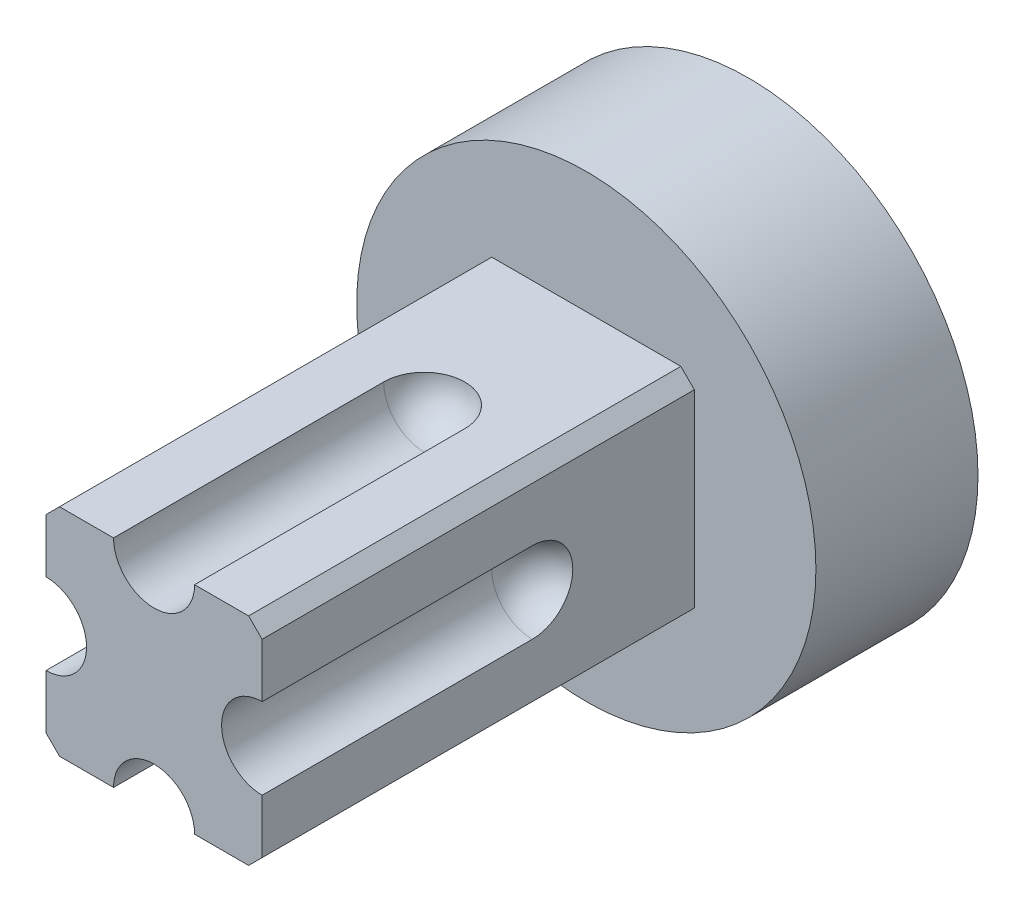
ISO-10303-21;
HEADER;
FILE_DESCRIPTION(('STEP AP214'),'2;1');
FILE_NAME('part.step','',(''),(''),'','','');
FILE_SCHEMA(('AUTOMOTIVE_DESIGN { 1 0 10303 214 1 1 1 1 }'));
ENDSEC;
DATA;
#1=APPLICATION_CONTEXT('core data for automotive mechanical design processes');
#2=APPLICATION_PROTOCOL_DEFINITION('international standard','automotive_design',2000,#1);
#3=PRODUCT_CONTEXT('',#1,'mechanical');
#4=PRODUCT('Part','Part','',(#3));
#5=PRODUCT_RELATED_PRODUCT_CATEGORY('part','',(#4));
#6=PRODUCT_DEFINITION_FORMATION('','',#4);
#7=PRODUCT_DEFINITION_CONTEXT('part definition',#1,'design');
#8=PRODUCT_DEFINITION('design','',#6,#7);
#9=PRODUCT_DEFINITION_SHAPE('','',#8);
#10=(LENGTH_UNIT() NAMED_UNIT(*) SI_UNIT(.MILLI.,.METRE.));
#11=(NAMED_UNIT(*) PLANE_ANGLE_UNIT() SI_UNIT($,.RADIAN.));
#12=(NAMED_UNIT(*) SI_UNIT($,.STERADIAN.) SOLID_ANGLE_UNIT());
#13=UNCERTAINTY_MEASURE_WITH_UNIT(LENGTH_MEASURE(1.E-05),#10,'distance_accuracy_value','');
#14=(GEOMETRIC_REPRESENTATION_CONTEXT(3) GLOBAL_UNCERTAINTY_ASSIGNED_CONTEXT((#13)) GLOBAL_UNIT_ASSIGNED_CONTEXT((#10,
#11,#12)) REPRESENTATION_CONTEXT('',''));
#15=CARTESIAN_POINT('',(0.,0.,0.));
#16=DIRECTION('',(0.,0.,1.));
#17=DIRECTION('',(1.,0.,0.));
#18=AXIS2_PLACEMENT_3D('',#15,#16,#17);
#19=CARTESIAN_POINT('',(-88.9,76.2000000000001,34.925));
#20=DIRECTION('',(0.,0.,1.));
#21=DIRECTION('',(1.,0.,0.));
#22=AXIS2_PLACEMENT_3D('',#19,#20,#21);
#23=PLANE('',#22);
#24=DIRECTION('',(1.,0.,0.));
#25=VECTOR('',#24,1.);
#26=CARTESIAN_POINT('',(-88.9,76.2000000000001,34.925));
#27=LINE('',#26,#25);
#28=CARTESIAN_POINT('',(-80.16875,76.2000000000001,34.925));
#29=VERTEX_POINT('',#28);
#30=CARTESIAN_POINT('',(-76.99375,76.2000000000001,34.925));
#31=VERTEX_POINT('',#30);
#32=EDGE_CURVE('E191',#29,#31,#27,.T.);
#33=ORIENTED_EDGE('',*,*,#32,.T.);
#34=DIRECTION('',(-0.707106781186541,-0.707106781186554,0.));
#35=VECTOR('',#34,1.);
#36=CARTESIAN_POINT('',(-82.9468749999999,70.2468750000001,34.925));
#37=LINE('',#36,#35);
#38=CARTESIAN_POINT('',(-76.2,76.9937500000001,34.925));
#39=VERTEX_POINT('',#38);
#40=EDGE_CURVE('E256',#31,#39,#37,.F.);
#41=ORIENTED_EDGE('',*,*,#40,.T.);
#42=DIRECTION('',(0.,1.,0.));
#43=VECTOR('',#42,1.);
#44=CARTESIAN_POINT('',(-76.2,88.9000000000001,34.925));
#45=LINE('',#44,#43);
#46=CARTESIAN_POINT('',(-76.2,80.1687500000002,34.925));
#47=VERTEX_POINT('',#46);
#48=EDGE_CURVE('E196',#39,#47,#45,.T.);
#49=ORIENTED_EDGE('',*,*,#48,.T.);
#50=CARTESIAN_POINT('',(-76.2,82.5500000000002,34.925));
#51=DIRECTION('',(0.,0.,1.));
#52=DIRECTION('',(1.,0.,0.));
#53=AXIS2_PLACEMENT_3D('',#50,#51,#52);
#54=CIRCLE('',#53,2.38125);
#55=CARTESIAN_POINT('',(-76.2,84.9312500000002,34.925));
#56=VERTEX_POINT('',#55);
#57=EDGE_CURVE('E172',#47,#56,#54,.F.);
#58=ORIENTED_EDGE('',*,*,#57,.T.);
#59=CARTESIAN_POINT('',(-76.2,88.1062500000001,34.925));
#60=VERTEX_POINT('',#59);
#61=EDGE_CURVE('E195',#56,#60,#45,.T.);
#62=ORIENTED_EDGE('',*,*,#61,.T.);
#63=DIRECTION('',(0.707106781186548,-0.707106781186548,0.));
#64=VECTOR('',#63,1.);
#65=CARTESIAN_POINT('',(-76.596875,88.5031250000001,34.925));
#66=LINE('',#65,#64);
#67=CARTESIAN_POINT('',(-76.99375,88.9000000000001,34.925));
#68=VERTEX_POINT('',#67);
#69=EDGE_CURVE('E250',#60,#68,#66,.F.);
#70=ORIENTED_EDGE('',*,*,#69,.T.);
#71=DIRECTION('',(-1.,0.,0.));
#72=VECTOR('',#71,1.);
#73=CARTESIAN_POINT('',(-88.9,88.9000000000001,34.925));
#74=LINE('',#73,#72);
#75=CARTESIAN_POINT('',(-80.1687500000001,88.9000000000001,34.925));
#76=VERTEX_POINT('',#75);
#77=EDGE_CURVE('E199',#68,#76,#74,.T.);
#78=ORIENTED_EDGE('',*,*,#77,.T.);
#79=CARTESIAN_POINT('',(-82.5500000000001,88.9000000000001,34.925));
#80=DIRECTION('',(0.,0.,1.));
#81=DIRECTION('',(1.,0.,0.));
#82=AXIS2_PLACEMENT_3D('',#79,#80,#81);
#83=CIRCLE('',#82,2.38125);
#84=CARTESIAN_POINT('',(-84.9312500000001,88.9000000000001,34.925));
#85=VERTEX_POINT('',#84);
#86=EDGE_CURVE('E178',#76,#85,#83,.F.);
#87=ORIENTED_EDGE('',*,*,#86,.T.);
#88=CARTESIAN_POINT('',(-88.10625,88.9000000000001,34.925));
#89=VERTEX_POINT('',#88);
#90=EDGE_CURVE('E198',#85,#89,#74,.T.);
#91=ORIENTED_EDGE('',*,*,#90,.T.);
#92=DIRECTION('',(0.707106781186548,0.707106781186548,0.));
#93=VECTOR('',#92,1.);
#94=CARTESIAN_POINT('',(-94.853125,82.1531250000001,34.925));
#95=LINE('',#94,#93);
#96=CARTESIAN_POINT('',(-88.9,88.1062500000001,34.925));
#97=VERTEX_POINT('',#96);
#98=EDGE_CURVE('E252',#89,#97,#95,.F.);
#99=ORIENTED_EDGE('',*,*,#98,.T.);
#100=DIRECTION('',(0.,-1.,0.));
#101=VECTOR('',#100,1.);
#102=CARTESIAN_POINT('',(-88.9,88.9000000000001,34.925));
#103=LINE('',#102,#101);
#104=CARTESIAN_POINT('',(-88.9,84.93125,34.925));
#105=VERTEX_POINT('',#104);
#106=EDGE_CURVE('E189',#97,#105,#103,.T.);
#107=ORIENTED_EDGE('',*,*,#106,.T.);
#108=CARTESIAN_POINT('',(-88.9,82.55,34.925));
#109=DIRECTION('',(0.,0.,1.));
#110=DIRECTION('',(1.,0.,0.));
#111=AXIS2_PLACEMENT_3D('',#108,#109,#110);
#112=CIRCLE('',#111,2.38125);
#113=CARTESIAN_POINT('',(-88.9,80.16875,34.925));
#114=VERTEX_POINT('',#113);
#115=EDGE_CURVE('E215',#105,#114,#112,.F.);
#116=ORIENTED_EDGE('',*,*,#115,.T.);
#117=CARTESIAN_POINT('',(-88.9,76.9937500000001,34.925));
#118=VERTEX_POINT('',#117);
#119=EDGE_CURVE('E192',#114,#118,#103,.T.);
#120=ORIENTED_EDGE('',*,*,#119,.T.);
#121=DIRECTION('',(-0.707106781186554,0.707106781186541,0.));
#122=VECTOR('',#121,1.);
#123=CARTESIAN_POINT('',(-88.503125,76.5968750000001,34.925));
#124=LINE('',#123,#122);
#125=CARTESIAN_POINT('',(-88.10625,76.2000000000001,34.925));
#126=VERTEX_POINT('',#125);
#127=EDGE_CURVE('E254',#118,#126,#124,.F.);
#128=ORIENTED_EDGE('',*,*,#127,.T.);
#129=CARTESIAN_POINT('',(-84.93125,76.2000000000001,34.925));
#130=VERTEX_POINT('',#129);
#131=EDGE_CURVE('E193',#126,#130,#27,.T.);
#132=ORIENTED_EDGE('',*,*,#131,.T.);
#133=CARTESIAN_POINT('',(-82.55,76.2000000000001,34.925));
#134=DIRECTION('',(0.,0.,1.));
#135=DIRECTION('',(1.,0.,0.));
#136=AXIS2_PLACEMENT_3D('',#133,#134,#135);
#137=CIRCLE('',#136,2.38125);
#138=EDGE_CURVE('E162',#130,#29,#137,.F.);
#139=ORIENTED_EDGE('',*,*,#138,.T.);
#140=EDGE_LOOP('',(#33,#41,#49,#58,#62,#70,#78,#87,#91,#99,#107,#116,#120,#128,#132,#139));
#141=FACE_BOUND('',#140,.T.);
#142=ADVANCED_FACE('F36',(#141),#23,.T.);
#143=CARTESIAN_POINT('',(-88.9,76.2000000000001,34.925));
#144=DIRECTION('',(0.,1.,0.));
#145=DIRECTION('',(0.,0.,1.));
#146=AXIS2_PLACEMENT_3D('',#143,#144,#145);
#147=PLANE('',#146);
#148=DIRECTION('',(1.,0.,0.));
#149=VECTOR('',#148,1.);
#150=CARTESIAN_POINT('',(-88.9,76.2000000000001,9.525));
#151=LINE('',#150,#149);
#152=CARTESIAN_POINT('',(-88.10625,76.2000000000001,9.525));
#153=VERTEX_POINT('',#152);
#154=CARTESIAN_POINT('',(-76.99375,76.2000000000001,9.525));
#155=VERTEX_POINT('',#154);
#156=EDGE_CURVE('E204',#153,#155,#151,.T.);
#157=ORIENTED_EDGE('',*,*,#156,.T.);
#158=DIRECTION('',(0.,0.,1.));
#159=VECTOR('',#158,1.);
#160=CARTESIAN_POINT('',(-76.99375,76.2000000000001,34.925));
#161=LINE('',#160,#159);
#162=EDGE_CURVE('E248',#155,#31,#161,.T.);
#163=ORIENTED_EDGE('',*,*,#162,.T.);
#164=ORIENTED_EDGE('',*,*,#32,.F.);
#165=DIRECTION('',(0.,0.,-1.));
#166=VECTOR('',#165,1.);
#167=CARTESIAN_POINT('',(-80.16875,76.2000000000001,53.2153504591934));
#168=LINE('',#167,#166);
#169=CARTESIAN_POINT('',(-80.16875,76.2000000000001,19.05));
#170=VERTEX_POINT('',#169);
#171=EDGE_CURVE('E238',#170,#29,#168,.F.);
#172=ORIENTED_EDGE('',*,*,#171,.F.);
#173=CARTESIAN_POINT('',(-82.55,76.2000000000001,19.05));
#174=DIRECTION('',(0.,1.,0.));
#175=DIRECTION('',(0.,0.,1.));
#176=AXIS2_PLACEMENT_3D('',#173,#174,#175);
#177=CIRCLE('',#176,2.38125);
#178=CARTESIAN_POINT('',(-84.93125,76.2000000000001,19.05));
#179=VERTEX_POINT('',#178);
#180=EDGE_CURVE('E236',#179,#170,#177,.F.);
#181=ORIENTED_EDGE('',*,*,#180,.F.);
#182=DIRECTION('',(0.,0.,-1.));
#183=VECTOR('',#182,1.);
#184=CARTESIAN_POINT('',(-84.93125,76.2000000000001,53.2153504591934));
#185=LINE('',#184,#183);
#186=EDGE_CURVE('E234',#130,#179,#185,.T.);
#187=ORIENTED_EDGE('',*,*,#186,.F.);
#188=ORIENTED_EDGE('',*,*,#131,.F.);
#189=DIRECTION('',(0.,0.,-1.));
#190=VECTOR('',#189,1.);
#191=CARTESIAN_POINT('',(-88.10625,76.2000000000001,34.925));
#192=LINE('',#191,#190);
#193=EDGE_CURVE('E245',#126,#153,#192,.T.);
#194=ORIENTED_EDGE('',*,*,#193,.T.);
#195=EDGE_LOOP('',(#157,#163,#164,#172,#181,#187,#188,#194));
#196=FACE_BOUND('',#195,.T.);
#197=ADVANCED_FACE('F289',(#196),#147,.F.);
#198=CARTESIAN_POINT('',(-76.2,88.9000000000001,34.925));
#199=DIRECTION('',(-1.,0.,0.));
#200=DIRECTION('',(0.,0.,1.));
#201=AXIS2_PLACEMENT_3D('',#198,#199,#200);
#202=PLANE('',#201);
#203=ORIENTED_EDGE('',*,*,#48,.F.);
#204=DIRECTION('',(0.,0.,-1.));
#205=VECTOR('',#204,1.);
#206=CARTESIAN_POINT('',(-76.2,76.9937500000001,34.925));
#207=LINE('',#206,#205);
#208=CARTESIAN_POINT('',(-76.2,76.9937500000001,9.525));
#209=VERTEX_POINT('',#208);
#210=EDGE_CURVE('E242',#39,#209,#207,.T.);
#211=ORIENTED_EDGE('',*,*,#210,.T.);
#212=DIRECTION('',(0.,1.,0.));
#213=VECTOR('',#212,1.);
#214=CARTESIAN_POINT('',(-76.2,88.9000000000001,9.525));
#215=LINE('',#214,#213);
#216=CARTESIAN_POINT('',(-76.2,88.1062500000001,9.525));
#217=VERTEX_POINT('',#216);
#218=EDGE_CURVE('E207',#209,#217,#215,.T.);
#219=ORIENTED_EDGE('',*,*,#218,.T.);
#220=DIRECTION('',(0.,0.,1.));
#221=VECTOR('',#220,1.);
#222=CARTESIAN_POINT('',(-76.2,88.1062500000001,34.925));
#223=LINE('',#222,#221);
#224=EDGE_CURVE('E240',#217,#60,#223,.T.);
#225=ORIENTED_EDGE('',*,*,#224,.T.);
#226=ORIENTED_EDGE('',*,*,#61,.F.);
#227=DIRECTION('',(0.,0.,-1.));
#228=VECTOR('',#227,1.);
#229=CARTESIAN_POINT('',(-76.2,84.9312500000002,53.2153504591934));
#230=LINE('',#229,#228);
#231=CARTESIAN_POINT('',(-76.2,84.9312500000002,19.05));
#232=VERTEX_POINT('',#231);
#233=EDGE_CURVE('E232',#232,#56,#230,.F.);
#234=ORIENTED_EDGE('',*,*,#233,.F.);
#235=CARTESIAN_POINT('',(-76.2,82.5500000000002,19.05));
#236=DIRECTION('',(-1.,0.,0.));
#237=DIRECTION('',(0.,0.,1.));
#238=AXIS2_PLACEMENT_3D('',#235,#236,#237);
#239=CIRCLE('',#238,2.38125);
#240=CARTESIAN_POINT('',(-76.2,80.1687500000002,19.05));
#241=VERTEX_POINT('',#240);
#242=EDGE_CURVE('E230',#241,#232,#239,.F.);
#243=ORIENTED_EDGE('',*,*,#242,.F.);
#244=DIRECTION('',(0.,0.,-1.));
#245=VECTOR('',#244,1.);
#246=CARTESIAN_POINT('',(-76.2,80.1687500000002,53.2153504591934));
#247=LINE('',#246,#245);
#248=EDGE_CURVE('E228',#47,#241,#247,.T.);
#249=ORIENTED_EDGE('',*,*,#248,.F.);
#250=EDGE_LOOP('',(#203,#211,#219,#225,#226,#234,#243,#249));
#251=FACE_BOUND('',#250,.T.);
#252=ADVANCED_FACE('F314',(#251),#202,.F.);
#253=CARTESIAN_POINT('',(-88.9,88.9000000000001,34.925));
#254=DIRECTION('',(0.,-1.,0.));
#255=DIRECTION('',(0.,0.,-1.));
#256=AXIS2_PLACEMENT_3D('',#253,#254,#255);
#257=PLANE('',#256);
#258=DIRECTION('',(-1.,0.,0.));
#259=VECTOR('',#258,1.);
#260=CARTESIAN_POINT('',(-88.9,88.9000000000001,9.525));
#261=LINE('',#260,#259);
#262=CARTESIAN_POINT('',(-76.99375,88.9000000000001,9.525));
#263=VERTEX_POINT('',#262);
#264=CARTESIAN_POINT('',(-88.10625,88.9000000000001,9.525));
#265=VERTEX_POINT('',#264);
#266=EDGE_CURVE('E210',#263,#265,#261,.T.);
#267=ORIENTED_EDGE('',*,*,#266,.T.);
#268=DIRECTION('',(0.,0.,1.));
#269=VECTOR('',#268,1.);
#270=CARTESIAN_POINT('',(-88.10625,88.9000000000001,34.925));
#271=LINE('',#270,#269);
#272=EDGE_CURVE('E265',#265,#89,#271,.T.);
#273=ORIENTED_EDGE('',*,*,#272,.T.);
#274=ORIENTED_EDGE('',*,*,#90,.F.);
#275=DIRECTION('',(0.,0.,-1.));
#276=VECTOR('',#275,1.);
#277=CARTESIAN_POINT('',(-84.9312500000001,88.9000000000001,53.2153504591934));
#278=LINE('',#277,#276);
#279=CARTESIAN_POINT('',(-84.9312500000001,88.9000000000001,19.05));
#280=VERTEX_POINT('',#279);
#281=EDGE_CURVE('E226',#280,#85,#278,.F.);
#282=ORIENTED_EDGE('',*,*,#281,.F.);
#283=CARTESIAN_POINT('',(-82.5500000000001,88.9000000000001,19.05));
#284=DIRECTION('',(0.,-1.,0.));
#285=DIRECTION('',(0.,0.,-1.));
#286=AXIS2_PLACEMENT_3D('',#283,#284,#285);
#287=CIRCLE('',#286,2.38125);
#288=CARTESIAN_POINT('',(-80.1687500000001,88.9000000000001,19.05));
#289=VERTEX_POINT('',#288);
#290=EDGE_CURVE('E224',#289,#280,#287,.F.);
#291=ORIENTED_EDGE('',*,*,#290,.F.);
#292=DIRECTION('',(0.,0.,-1.));
#293=VECTOR('',#292,1.);
#294=CARTESIAN_POINT('',(-80.1687500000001,88.9000000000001,53.2153504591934));
#295=LINE('',#294,#293);
#296=EDGE_CURVE('E222',#76,#289,#295,.T.);
#297=ORIENTED_EDGE('',*,*,#296,.F.);
#298=ORIENTED_EDGE('',*,*,#77,.F.);
#299=DIRECTION('',(0.,0.,-1.));
#300=VECTOR('',#299,1.);
#301=CARTESIAN_POINT('',(-76.99375,88.9000000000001,34.925));
#302=LINE('',#301,#300);
#303=EDGE_CURVE('E263',#68,#263,#302,.T.);
#304=ORIENTED_EDGE('',*,*,#303,.T.);
#305=EDGE_LOOP('',(#267,#273,#274,#282,#291,#297,#298,#304));
#306=FACE_BOUND('',#305,.T.);
#307=ADVANCED_FACE('F320',(#306),#257,.F.);
#308=CARTESIAN_POINT('',(-88.9,88.9000000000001,34.925));
#309=DIRECTION('',(1.,0.,0.));
#310=DIRECTION('',(0.,0.,-1.));
#311=AXIS2_PLACEMENT_3D('',#308,#309,#310);
#312=PLANE('',#311);
#313=DIRECTION('',(0.,-1.,0.));
#314=VECTOR('',#313,1.);
#315=CARTESIAN_POINT('',(-88.9,88.9000000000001,9.525));
#316=LINE('',#315,#314);
#317=CARTESIAN_POINT('',(-88.9,88.1062500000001,9.525));
#318=VERTEX_POINT('',#317);
#319=CARTESIAN_POINT('',(-88.9,76.9937500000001,9.525));
#320=VERTEX_POINT('',#319);
#321=EDGE_CURVE('E188',#318,#320,#316,.T.);
#322=ORIENTED_EDGE('',*,*,#321,.T.);
#323=DIRECTION('',(0.,0.,1.));
#324=VECTOR('',#323,1.);
#325=CARTESIAN_POINT('',(-88.9,76.9937500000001,34.925));
#326=LINE('',#325,#324);
#327=EDGE_CURVE('E261',#320,#118,#326,.T.);
#328=ORIENTED_EDGE('',*,*,#327,.T.);
#329=ORIENTED_EDGE('',*,*,#119,.F.);
#330=DIRECTION('',(0.,0.,-1.));
#331=VECTOR('',#330,1.);
#332=CARTESIAN_POINT('',(-88.9,80.16875,53.2153504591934));
#333=LINE('',#332,#331);
#334=CARTESIAN_POINT('',(-88.9,80.16875,19.05));
#335=VERTEX_POINT('',#334);
#336=EDGE_CURVE('E186',#335,#114,#333,.F.);
#337=ORIENTED_EDGE('',*,*,#336,.F.);
#338=CARTESIAN_POINT('',(-88.9,82.55,19.05));
#339=DIRECTION('',(1.,0.,0.));
#340=DIRECTION('',(0.,0.,-1.));
#341=AXIS2_PLACEMENT_3D('',#338,#339,#340);
#342=CIRCLE('',#341,2.38125);
#343=CARTESIAN_POINT('',(-88.9,84.93125,19.05));
#344=VERTEX_POINT('',#343);
#345=EDGE_CURVE('E220',#344,#335,#342,.F.);
#346=ORIENTED_EDGE('',*,*,#345,.F.);
#347=DIRECTION('',(0.,0.,-1.));
#348=VECTOR('',#347,1.);
#349=CARTESIAN_POINT('',(-88.9,84.93125,53.2153504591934));
#350=LINE('',#349,#348);
#351=EDGE_CURVE('E184',#105,#344,#350,.T.);
#352=ORIENTED_EDGE('',*,*,#351,.F.);
#353=ORIENTED_EDGE('',*,*,#106,.F.);
#354=DIRECTION('',(0.,0.,-1.));
#355=VECTOR('',#354,1.);
#356=CARTESIAN_POINT('',(-88.9,88.1062500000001,34.925));
#357=LINE('',#356,#355);
#358=EDGE_CURVE('E258',#97,#318,#357,.T.);
#359=ORIENTED_EDGE('',*,*,#358,.T.);
#360=EDGE_LOOP('',(#322,#328,#329,#337,#346,#352,#353,#359));
#361=FACE_BOUND('',#360,.T.);
#362=ADVANCED_FACE('F276',(#361),#312,.F.);
#363=CARTESIAN_POINT('',(-82.55,82.5500000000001,9.525));
#364=DIRECTION('',(0.,0.,1.));
#365=DIRECTION('',(1.,0.,0.));
#366=AXIS2_PLACEMENT_3D('',#363,#364,#365);
#367=PLANE('',#366);
#368=CARTESIAN_POINT('',(-82.55,82.5500000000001,9.525));
#369=DIRECTION('',(0.,0.,1.));
#370=DIRECTION('',(1.,0.,0.));
#371=AXIS2_PLACEMENT_3D('',#368,#369,#370);
#372=CIRCLE('',#371,13.49375);
#373=CARTESIAN_POINT('',(-69.05625,82.5500000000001,9.525));
#374=VERTEX_POINT('',#373);
#375=EDGE_CURVE('E212',#374,#374,#372,.T.);
#376=ORIENTED_EDGE('',*,*,#375,.T.);
#377=EDGE_LOOP('',(#376));
#378=FACE_BOUND('',#377,.T.);
#379=ORIENTED_EDGE('',*,*,#156,.F.);
#380=DIRECTION('',(0.707106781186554,-0.707106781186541,0.));
#381=VECTOR('',#380,1.);
#382=CARTESIAN_POINT('',(-88.10625,76.2000000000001,9.525));
#383=LINE('',#382,#381);
#384=EDGE_CURVE('E269',#153,#320,#383,.F.);
#385=ORIENTED_EDGE('',*,*,#384,.T.);
#386=ORIENTED_EDGE('',*,*,#321,.F.);
#387=DIRECTION('',(-0.707106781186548,-0.707106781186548,0.));
#388=VECTOR('',#387,1.);
#389=CARTESIAN_POINT('',(-88.9,88.1062500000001,9.525));
#390=LINE('',#389,#388);
#391=EDGE_CURVE('E44',#318,#265,#390,.F.);
#392=ORIENTED_EDGE('',*,*,#391,.T.);
#393=ORIENTED_EDGE('',*,*,#266,.F.);
#394=DIRECTION('',(-0.707106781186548,0.707106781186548,0.));
#395=VECTOR('',#394,1.);
#396=CARTESIAN_POINT('',(-76.99375,88.9000000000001,9.525));
#397=LINE('',#396,#395);
#398=EDGE_CURVE('E11',#263,#217,#397,.F.);
#399=ORIENTED_EDGE('',*,*,#398,.T.);
#400=ORIENTED_EDGE('',*,*,#218,.F.);
#401=DIRECTION('',(0.707106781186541,0.707106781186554,0.));
#402=VECTOR('',#401,1.);
#403=CARTESIAN_POINT('',(-76.2,76.9937500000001,9.525));
#404=LINE('',#403,#402);
#405=EDGE_CURVE('E267',#209,#155,#404,.F.);
#406=ORIENTED_EDGE('',*,*,#405,.T.);
#407=EDGE_LOOP('',(#379,#385,#386,#392,#393,#399,#400,#406));
#408=FACE_BOUND('',#407,.T.);
#409=ADVANCED_FACE('F271',(#378,#408),#367,.T.);
#410=CARTESIAN_POINT('',(-82.55,82.5500000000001,9.525));
#411=DIRECTION('',(0.,0.,-1.));
#412=DIRECTION('',(-1.,0.,0.));
#413=AXIS2_PLACEMENT_3D('',#410,#411,#412);
#414=CYLINDRICAL_SURFACE('',#413,13.49375);
#415=ORIENTED_EDGE('',*,*,#375,.F.);
#416=EDGE_LOOP('',(#415));
#417=FACE_BOUND('',#416,.T.);
#418=CARTESIAN_POINT('',(-82.55,82.5500000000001,0.));
#419=DIRECTION('',(0.,0.,1.));
#420=DIRECTION('',(1.,0.,0.));
#421=AXIS2_PLACEMENT_3D('',#418,#419,#420);
#422=CIRCLE('',#421,13.49375);
#423=CARTESIAN_POINT('',(-69.05625,82.5500000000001,0.));
#424=VERTEX_POINT('',#423);
#425=EDGE_CURVE('E201',#424,#424,#422,.T.);
#426=ORIENTED_EDGE('',*,*,#425,.T.);
#427=EDGE_LOOP('',(#426));
#428=FACE_BOUND('',#427,.T.);
#429=ADVANCED_FACE('F331',(#417,#428),#414,.T.);
#430=CARTESIAN_POINT('',(-82.55,82.5500000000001,0.));
#431=DIRECTION('',(0.,0.,1.));
#432=DIRECTION('',(1.,0.,0.));
#433=AXIS2_PLACEMENT_3D('',#430,#431,#432);
#434=PLANE('',#433);
#435=CARTESIAN_POINT('',(-82.55,82.5500000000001,0.));
#436=DIRECTION('',(0.,0.,-1.));
#437=DIRECTION('',(-1.,0.,0.));
#438=AXIS2_PLACEMENT_3D('',#435,#436,#437);
#439=CIRCLE('',#438,3.2639);
#440=CARTESIAN_POINT('',(-85.8139,82.5500000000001,0.));
#441=VERTEX_POINT('',#440);
#442=EDGE_CURVE('E159',#441,#441,#439,.T.);
#443=ORIENTED_EDGE('',*,*,#442,.F.);
#444=EDGE_LOOP('',(#443));
#445=FACE_BOUND('',#444,.T.);
#446=ORIENTED_EDGE('',*,*,#425,.F.);
#447=EDGE_LOOP('',(#446));
#448=FACE_BOUND('',#447,.T.);
#449=ADVANCED_FACE('F333',(#445,#448),#434,.F.);
#450=CARTESIAN_POINT('',(-88.9,82.55,19.05));
#451=DIRECTION('',(0.,0.,-1.));
#452=DIRECTION('',(1.,0.,0.));
#453=AXIS2_PLACEMENT_3D('',#450,#451,#452);
#454=SPHERICAL_SURFACE('',#453,2.38125);
#455=ORIENTED_EDGE('',*,*,#345,.T.);
#456=CARTESIAN_POINT('',(-88.9,82.55,19.05));
#457=DIRECTION('',(0.,0.,-1.));
#458=DIRECTION('',(-1.,0.,0.));
#459=AXIS2_PLACEMENT_3D('',#456,#457,#458);
#460=CIRCLE('',#459,2.38125);
#461=EDGE_CURVE('E181',#344,#335,#460,.T.);
#462=ORIENTED_EDGE('',*,*,#461,.F.);
#463=EDGE_LOOP('',(#455,#462));
#464=FACE_BOUND('',#463,.T.);
#465=ADVANCED_FACE('F318',(#464),#454,.F.);
#466=CARTESIAN_POINT('',(-88.9,82.55,53.2153504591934));
#467=DIRECTION('',(0.,0.,-1.));
#468=DIRECTION('',(-1.,0.,0.));
#469=AXIS2_PLACEMENT_3D('',#466,#467,#468);
#470=CYLINDRICAL_SURFACE('',#469,2.38125);
#471=ORIENTED_EDGE('',*,*,#336,.T.);
#472=ORIENTED_EDGE('',*,*,#115,.F.);
#473=ORIENTED_EDGE('',*,*,#351,.T.);
#474=ORIENTED_EDGE('',*,*,#461,.T.);
#475=EDGE_LOOP('',(#471,#472,#473,#474));
#476=FACE_BOUND('',#475,.T.);
#477=ADVANCED_FACE('F360',(#476),#470,.F.);
#478=CARTESIAN_POINT('',(-82.5500000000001,88.9000000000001,19.05));
#479=DIRECTION('',(0.,0.,-1.));
#480=DIRECTION('',(0.,-1.,0.));
#481=AXIS2_PLACEMENT_3D('',#478,#479,#480);
#482=SPHERICAL_SURFACE('',#481,2.38125);
#483=ORIENTED_EDGE('',*,*,#290,.T.);
#484=CARTESIAN_POINT('',(-82.5500000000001,88.9000000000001,19.05));
#485=DIRECTION('',(0.,0.,-1.));
#486=DIRECTION('',(0.,1.,0.));
#487=AXIS2_PLACEMENT_3D('',#484,#485,#486);
#488=CIRCLE('',#487,2.38125);
#489=EDGE_CURVE('E175',#289,#280,#488,.T.);
#490=ORIENTED_EDGE('',*,*,#489,.F.);
#491=EDGE_LOOP('',(#483,#490));
#492=FACE_BOUND('',#491,.T.);
#493=ADVANCED_FACE('F366',(#492),#482,.F.);
#494=CARTESIAN_POINT('',(-82.5500000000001,88.9000000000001,53.2153504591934));
#495=DIRECTION('',(0.,0.,-1.));
#496=DIRECTION('',(0.,1.,0.));
#497=AXIS2_PLACEMENT_3D('',#494,#495,#496);
#498=CYLINDRICAL_SURFACE('',#497,2.38125);
#499=ORIENTED_EDGE('',*,*,#281,.T.);
#500=ORIENTED_EDGE('',*,*,#86,.F.);
#501=ORIENTED_EDGE('',*,*,#296,.T.);
#502=ORIENTED_EDGE('',*,*,#489,.T.);
#503=EDGE_LOOP('',(#499,#500,#501,#502));
#504=FACE_BOUND('',#503,.T.);
#505=ADVANCED_FACE('F370',(#504),#498,.F.);
#506=CARTESIAN_POINT('',(-76.2,82.5500000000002,19.05));
#507=DIRECTION('',(0.,0.,-1.));
#508=DIRECTION('',(-1.,0.,0.));
#509=AXIS2_PLACEMENT_3D('',#506,#507,#508);
#510=SPHERICAL_SURFACE('',#509,2.38125);
#511=ORIENTED_EDGE('',*,*,#242,.T.);
#512=CARTESIAN_POINT('',(-76.2,82.5500000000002,19.05));
#513=DIRECTION('',(0.,0.,-1.));
#514=DIRECTION('',(1.,0.,0.));
#515=AXIS2_PLACEMENT_3D('',#512,#513,#514);
#516=CIRCLE('',#515,2.38125);
#517=EDGE_CURVE('E169',#241,#232,#516,.T.);
#518=ORIENTED_EDGE('',*,*,#517,.F.);
#519=EDGE_LOOP('',(#511,#518));
#520=FACE_BOUND('',#519,.T.);
#521=ADVANCED_FACE('F306',(#520),#510,.F.);
#522=CARTESIAN_POINT('',(-76.2,82.5500000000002,53.2153504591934));
#523=DIRECTION('',(0.,0.,-1.));
#524=DIRECTION('',(1.,0.,0.));
#525=AXIS2_PLACEMENT_3D('',#522,#523,#524);
#526=CYLINDRICAL_SURFACE('',#525,2.38125);
#527=ORIENTED_EDGE('',*,*,#233,.T.);
#528=ORIENTED_EDGE('',*,*,#57,.F.);
#529=ORIENTED_EDGE('',*,*,#248,.T.);
#530=ORIENTED_EDGE('',*,*,#517,.T.);
#531=EDGE_LOOP('',(#527,#528,#529,#530));
#532=FACE_BOUND('',#531,.T.);
#533=ADVANCED_FACE('F298',(#532),#526,.F.);
#534=CARTESIAN_POINT('',(-82.55,76.2000000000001,19.05));
#535=DIRECTION('',(0.,0.,-1.));
#536=DIRECTION('',(0.,1.,0.));
#537=AXIS2_PLACEMENT_3D('',#534,#535,#536);
#538=SPHERICAL_SURFACE('',#537,2.38125);
#539=ORIENTED_EDGE('',*,*,#180,.T.);
#540=CARTESIAN_POINT('',(-82.55,76.2000000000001,19.05));
#541=DIRECTION('',(0.,0.,-1.));
#542=DIRECTION('',(0.,-1.,0.));
#543=AXIS2_PLACEMENT_3D('',#540,#541,#542);
#544=CIRCLE('',#543,2.38125);
#545=EDGE_CURVE('E158',#179,#170,#544,.T.);
#546=ORIENTED_EDGE('',*,*,#545,.F.);
#547=EDGE_LOOP('',(#539,#546));
#548=FACE_BOUND('',#547,.T.);
#549=ADVANCED_FACE('F296',(#548),#538,.F.);
#550=CARTESIAN_POINT('',(-82.55,76.2000000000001,53.2153504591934));
#551=DIRECTION('',(0.,0.,-1.));
#552=DIRECTION('',(0.,-1.,0.));
#553=AXIS2_PLACEMENT_3D('',#550,#551,#552);
#554=CYLINDRICAL_SURFACE('',#553,2.38125);
#555=ORIENTED_EDGE('',*,*,#171,.T.);
#556=ORIENTED_EDGE('',*,*,#138,.F.);
#557=ORIENTED_EDGE('',*,*,#186,.T.);
#558=ORIENTED_EDGE('',*,*,#545,.T.);
#559=EDGE_LOOP('',(#555,#556,#557,#558));
#560=FACE_BOUND('',#559,.T.);
#561=ADVANCED_FACE('F294',(#560),#554,.F.);
#562=CARTESIAN_POINT('',(-76.2,76.9937500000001,34.925));
#563=DIRECTION('',(-0.707106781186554,0.707106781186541,0.));
#564=DIRECTION('',(-0.707106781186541,-0.707106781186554,0.));
#565=AXIS2_PLACEMENT_3D('',#562,#563,#564);
#566=PLANE('',#565);
#567=ORIENTED_EDGE('',*,*,#40,.F.);
#568=ORIENTED_EDGE('',*,*,#162,.F.);
#569=ORIENTED_EDGE('',*,*,#405,.F.);
#570=ORIENTED_EDGE('',*,*,#210,.F.);
#571=EDGE_LOOP('',(#567,#568,#569,#570));
#572=FACE_BOUND('',#571,.T.);
#573=ADVANCED_FACE('F304',(#572),#566,.F.);
#574=CARTESIAN_POINT('',(-88.10625,76.2000000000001,34.925));
#575=DIRECTION('',(0.707106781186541,0.707106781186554,0.));
#576=DIRECTION('',(-0.707106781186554,0.707106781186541,0.));
#577=AXIS2_PLACEMENT_3D('',#574,#575,#576);
#578=PLANE('',#577);
#579=ORIENTED_EDGE('',*,*,#127,.F.);
#580=ORIENTED_EDGE('',*,*,#327,.F.);
#581=ORIENTED_EDGE('',*,*,#384,.F.);
#582=ORIENTED_EDGE('',*,*,#193,.F.);
#583=EDGE_LOOP('',(#579,#580,#581,#582));
#584=FACE_BOUND('',#583,.T.);
#585=ADVANCED_FACE('F282',(#584),#578,.F.);
#586=CARTESIAN_POINT('',(-88.9,88.1062500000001,34.925));
#587=DIRECTION('',(0.707106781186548,-0.707106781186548,0.));
#588=DIRECTION('',(0.707106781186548,0.707106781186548,0.));
#589=AXIS2_PLACEMENT_3D('',#586,#587,#588);
#590=PLANE('',#589);
#591=ORIENTED_EDGE('',*,*,#98,.F.);
#592=ORIENTED_EDGE('',*,*,#272,.F.);
#593=ORIENTED_EDGE('',*,*,#391,.F.);
#594=ORIENTED_EDGE('',*,*,#358,.F.);
#595=EDGE_LOOP('',(#591,#592,#593,#594));
#596=FACE_BOUND('',#595,.T.);
#597=ADVANCED_FACE('F344',(#596),#590,.F.);
#598=CARTESIAN_POINT('',(-76.99375,88.9000000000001,34.925));
#599=DIRECTION('',(-0.707106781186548,-0.707106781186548,0.));
#600=DIRECTION('',(0.707106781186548,-0.707106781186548,0.));
#601=AXIS2_PLACEMENT_3D('',#598,#599,#600);
#602=PLANE('',#601);
#603=ORIENTED_EDGE('',*,*,#69,.F.);
#604=ORIENTED_EDGE('',*,*,#224,.F.);
#605=ORIENTED_EDGE('',*,*,#398,.F.);
#606=ORIENTED_EDGE('',*,*,#303,.F.);
#607=EDGE_LOOP('',(#603,#604,#605,#606));
#608=FACE_BOUND('',#607,.T.);
#609=ADVANCED_FACE('F38',(#608),#602,.F.);
#610=CARTESIAN_POINT('',(-82.55,82.5500000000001,15.875));
#611=DIRECTION('',(0.,0.,-1.));
#612=DIRECTION('',(-1.,0.,0.));
#613=AXIS2_PLACEMENT_3D('',#610,#611,#612);
#614=CONICAL_SURFACE('',#613,3.2639,1.02974425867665);
#615=CARTESIAN_POINT('',(-82.55,82.5500000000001,17.8361489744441));
#616=VERTEX_POINT('',#615);
#617=VERTEX_LOOP('',#616);
#618=FACE_BOUND('',#617,.T.);
#619=CARTESIAN_POINT('',(-82.55,82.5500000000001,15.875));
#620=DIRECTION('',(0.,0.,-1.));
#621=DIRECTION('',(-1.,0.,0.));
#622=AXIS2_PLACEMENT_3D('',#619,#620,#621);
#623=CIRCLE('',#622,3.2639);
#624=CARTESIAN_POINT('',(-85.8139,82.5500000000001,15.875));
#625=VERTEX_POINT('',#624);
#626=EDGE_CURVE('E156',#625,#625,#623,.T.);
#627=ORIENTED_EDGE('',*,*,#626,.T.);
#628=EDGE_LOOP('',(#627));
#629=FACE_BOUND('',#628,.T.);
#630=ADVANCED_FACE('F149',(#618,#629),#614,.F.);
#631=CARTESIAN_POINT('',(-82.55,82.5500000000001,0.));
#632=DIRECTION('',(0.,0.,-1.));
#633=DIRECTION('',(-1.,0.,0.));
#634=AXIS2_PLACEMENT_3D('',#631,#632,#633);
#635=CYLINDRICAL_SURFACE('',#634,3.2639);
#636=ORIENTED_EDGE('',*,*,#626,.F.);
#637=EDGE_LOOP('',(#636));
#638=FACE_BOUND('',#637,.T.);
#639=ORIENTED_EDGE('',*,*,#442,.T.);
#640=EDGE_LOOP('',(#639));
#641=FACE_BOUND('',#640,.T.);
#642=ADVANCED_FACE('F152',(#638,#641),#635,.F.);
#643=CLOSED_SHELL('',(#142,#197,#252,#307,#362,#409,#429,#449,#465,#477,#493,#505,#521,#533,
#549,#561,#573,#585,#597,#609,#630,#642));
#644=MANIFOLD_SOLID_BREP('B2',#643);
#645=ADVANCED_BREP_SHAPE_REPRESENTATION('',(#18,#644),#14);
#646=SHAPE_DEFINITION_REPRESENTATION(#9,#645);
ENDSEC;
END-ISO-10303-21;
